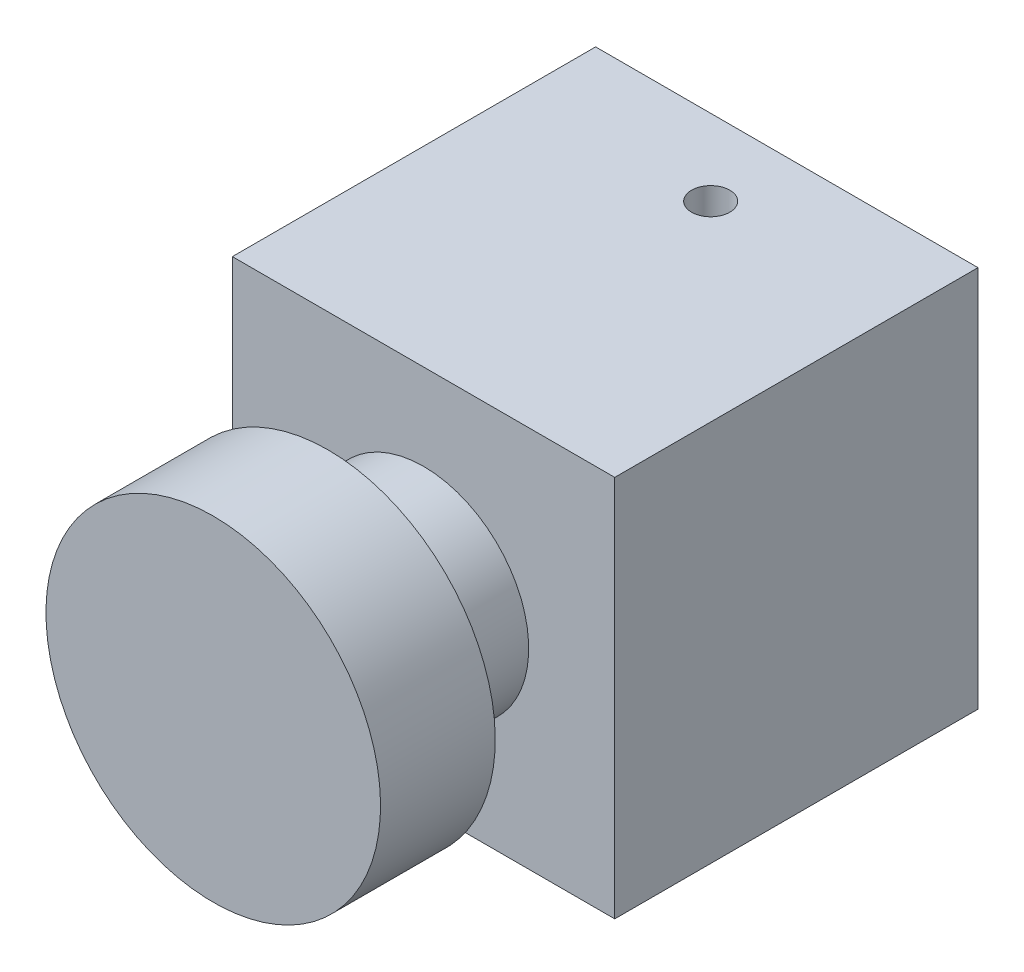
from build123d import *

# Parameters (mm, degrees)
ESQUISSE1_W      = 40
ESQUISSE1_H      = 40
EXTRUSION1_DEPTH = 38
ESQUISSE2_R      = 2
EXTRUSION2_DEPTH = 5


with BuildPart() as part:
    # EW_SKETCH → R_volution1 (revolve)
    with BuildSketch(Plane(origin=(0, 0, 0), x_dir=(0, 0, -1), z_dir=(1, 0, 0))):
        Polygon((48, 11), (0, 11), (0, 17.5), (-12, 17.5), (-12, 0), (0, 0), (48, 0), align=None)
    revolve(axis=Axis((0, 0, 0), (0, 0, 1)))

    # Esquisse1 → Extrusion1 (add)
    with BuildSketch(Plane(origin=(0, 0, -48), x_dir=(-1, 0, 0), z_dir=(0, 0, -1))):
        Rectangle(ESQUISSE1_W, ESQUISSE1_H)
    extrude(amount=-EXTRUSION1_DEPTH)

    # Esquisse2 → Extrusion2 (cut)
    with BuildSketch(Plane(origin=(0, 20, 0), x_dir=(1, 0, 0), z_dir=(0, 1, 0))):
        with Locations(Location((0, 40.03671104, 0), (0, 0, 270))):
            Circle(ESQUISSE2_R)
    extrusion2 = extrude(amount=-EXTRUSION2_DEPTH, mode=Mode.SUBTRACT)

    # Sym_trie1: Extrusion2 across plane
    add(extrusion2.mirror(Plane.ZX), mode=Mode.SUBTRACT)


solid = part.part
